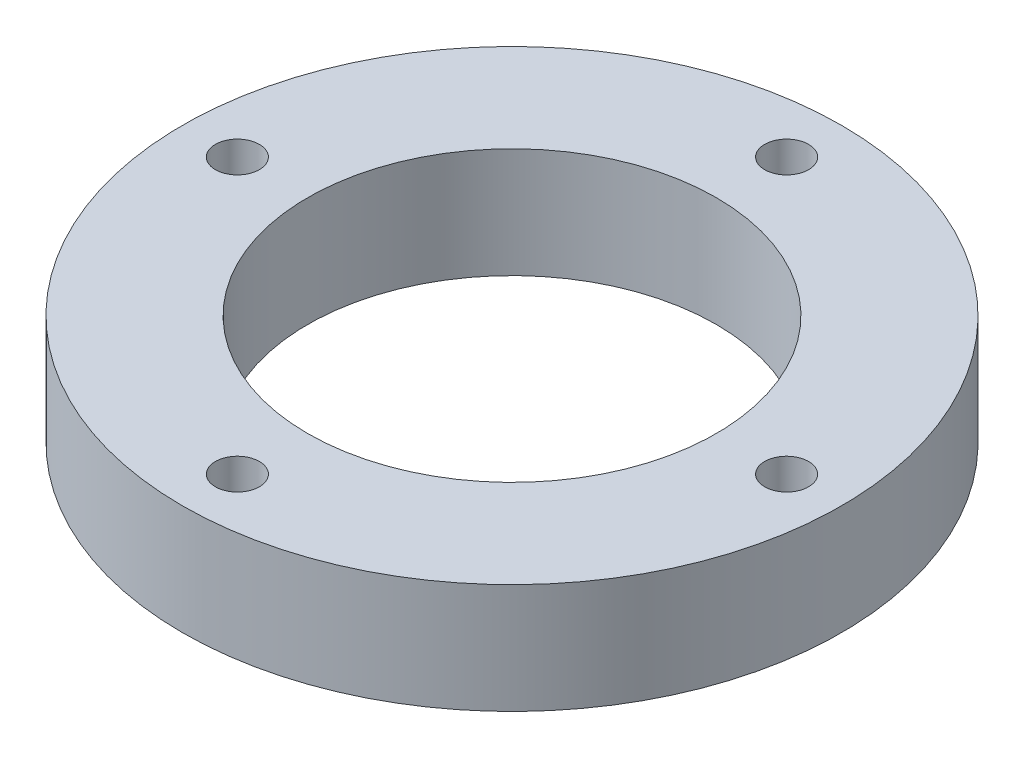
ISO-10303-21;
HEADER;
FILE_DESCRIPTION(('STEP AP214'),'2;1');
FILE_NAME('part.step','',(''),(''),'','','');
FILE_SCHEMA(('AUTOMOTIVE_DESIGN { 1 0 10303 214 1 1 1 1 }'));
ENDSEC;
DATA;
#1=APPLICATION_CONTEXT('core data for automotive mechanical design processes');
#2=APPLICATION_PROTOCOL_DEFINITION('international standard','automotive_design',2000,#1);
#3=PRODUCT_CONTEXT('',#1,'mechanical');
#4=PRODUCT('Part','Part','',(#3));
#5=PRODUCT_RELATED_PRODUCT_CATEGORY('part','',(#4));
#6=PRODUCT_DEFINITION_FORMATION('','',#4);
#7=PRODUCT_DEFINITION_CONTEXT('part definition',#1,'design');
#8=PRODUCT_DEFINITION('design','',#6,#7);
#9=PRODUCT_DEFINITION_SHAPE('','',#8);
#10=(LENGTH_UNIT() NAMED_UNIT(*) SI_UNIT(.MILLI.,.METRE.));
#11=(NAMED_UNIT(*) PLANE_ANGLE_UNIT() SI_UNIT($,.RADIAN.));
#12=(NAMED_UNIT(*) SI_UNIT($,.STERADIAN.) SOLID_ANGLE_UNIT());
#13=UNCERTAINTY_MEASURE_WITH_UNIT(LENGTH_MEASURE(1.E-05),#10,'distance_accuracy_value','');
#14=(GEOMETRIC_REPRESENTATION_CONTEXT(3) GLOBAL_UNCERTAINTY_ASSIGNED_CONTEXT((#13)) GLOBAL_UNIT_ASSIGNED_CONTEXT((#10,
#11,#12)) REPRESENTATION_CONTEXT('',''));
#15=CARTESIAN_POINT('',(0.,0.,0.));
#16=DIRECTION('',(0.,0.,1.));
#17=DIRECTION('',(1.,0.,0.));
#18=AXIS2_PLACEMENT_3D('',#15,#16,#17);
#19=CARTESIAN_POINT('',(0.,0.,0.));
#20=DIRECTION('',(0.,1.,0.));
#21=DIRECTION('',(0.,0.,1.));
#22=AXIS2_PLACEMENT_3D('',#19,#20,#21);
#23=PLANE('',#22);
#24=CARTESIAN_POINT('',(0.,0.,0.));
#25=DIRECTION('',(0.,-1.,0.));
#26=DIRECTION('',(0.,0.,-1.));
#27=AXIS2_PLACEMENT_3D('',#24,#25,#26);
#28=CIRCLE('',#27,30.);
#29=CARTESIAN_POINT('',(0.,0.,-30.));
#30=VERTEX_POINT('',#29);
#31=EDGE_CURVE('E41',#30,#30,#28,.F.);
#32=ORIENTED_EDGE('',*,*,#31,.F.);
#33=EDGE_LOOP('',(#32));
#34=FACE_BOUND('',#33,.T.);
#35=CARTESIAN_POINT('',(0.,0.,0.));
#36=DIRECTION('',(0.,1.,0.));
#37=DIRECTION('',(0.,0.,1.));
#38=AXIS2_PLACEMENT_3D('',#35,#36,#37);
#39=CIRCLE('',#38,18.6);
#40=CARTESIAN_POINT('',(0.,0.,18.6));
#41=VERTEX_POINT('',#40);
#42=EDGE_CURVE('E44',#41,#41,#39,.T.);
#43=ORIENTED_EDGE('',*,*,#42,.T.);
#44=EDGE_LOOP('',(#43));
#45=FACE_BOUND('',#44,.T.);
#46=CARTESIAN_POINT('',(0.,0.,-25.));
#47=DIRECTION('',(0.,1.,0.));
#48=DIRECTION('',(0.,0.,1.));
#49=AXIS2_PLACEMENT_3D('',#46,#47,#48);
#50=CIRCLE('',#49,2.);
#51=CARTESIAN_POINT('',(0.,0.,-23.));
#52=VERTEX_POINT('',#51);
#53=EDGE_CURVE('E47',#52,#52,#50,.T.);
#54=ORIENTED_EDGE('',*,*,#53,.T.);
#55=EDGE_LOOP('',(#54));
#56=FACE_BOUND('',#55,.T.);
#57=CARTESIAN_POINT('',(25.,0.,0.));
#58=DIRECTION('',(0.,1.,0.));
#59=DIRECTION('',(0.,0.,1.));
#60=AXIS2_PLACEMENT_3D('',#57,#58,#59);
#61=CIRCLE('',#60,2.);
#62=CARTESIAN_POINT('',(25.,0.,2.00000000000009));
#63=VERTEX_POINT('',#62);
#64=EDGE_CURVE('E50',#63,#63,#61,.T.);
#65=ORIENTED_EDGE('',*,*,#64,.T.);
#66=EDGE_LOOP('',(#65));
#67=FACE_BOUND('',#66,.T.);
#68=CARTESIAN_POINT('',(0.,0.,25.));
#69=DIRECTION('',(0.,1.,0.));
#70=DIRECTION('',(0.,0.,1.));
#71=AXIS2_PLACEMENT_3D('',#68,#69,#70);
#72=CIRCLE('',#71,2.);
#73=CARTESIAN_POINT('',(0.,0.,27.));
#74=VERTEX_POINT('',#73);
#75=EDGE_CURVE('E52',#74,#74,#72,.T.);
#76=ORIENTED_EDGE('',*,*,#75,.T.);
#77=EDGE_LOOP('',(#76));
#78=FACE_BOUND('',#77,.T.);
#79=CARTESIAN_POINT('',(-25.,0.,-2.61861100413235E-13));
#80=DIRECTION('',(0.,1.,0.));
#81=DIRECTION('',(0.,0.,1.));
#82=AXIS2_PLACEMENT_3D('',#79,#80,#81);
#83=CIRCLE('',#82,2.);
#84=CARTESIAN_POINT('',(-25.,0.,1.99999999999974));
#85=VERTEX_POINT('',#84);
#86=EDGE_CURVE('E18',#85,#85,#83,.T.);
#87=ORIENTED_EDGE('',*,*,#86,.T.);
#88=EDGE_LOOP('',(#87));
#89=FACE_BOUND('',#88,.T.);
#90=ADVANCED_FACE('F15',(#34,#45,#56,#67,#78,#89),#23,.F.);
#91=CARTESIAN_POINT('',(-25.,0.,-2.61861100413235E-13));
#92=DIRECTION('',(0.,1.,0.));
#93=DIRECTION('',(0.,0.,1.));
#94=AXIS2_PLACEMENT_3D('',#91,#92,#93);
#95=CYLINDRICAL_SURFACE('',#94,2.);
#96=CARTESIAN_POINT('',(-25.,10.,-2.61861100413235E-13));
#97=DIRECTION('',(0.,1.,0.));
#98=DIRECTION('',(0.,0.,1.));
#99=AXIS2_PLACEMENT_3D('',#96,#97,#98);
#100=CIRCLE('',#99,2.);
#101=CARTESIAN_POINT('',(-25.,10.,1.99999999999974));
#102=VERTEX_POINT('',#101);
#103=EDGE_CURVE('E38',#102,#102,#100,.F.);
#104=ORIENTED_EDGE('',*,*,#103,.F.);
#105=EDGE_LOOP('',(#104));
#106=FACE_BOUND('',#105,.T.);
#107=ORIENTED_EDGE('',*,*,#86,.F.);
#108=EDGE_LOOP('',(#107));
#109=FACE_BOUND('',#108,.T.);
#110=ADVANCED_FACE('F60',(#106,#109),#95,.F.);
#111=CARTESIAN_POINT('',(0.,0.,25.));
#112=DIRECTION('',(0.,1.,0.));
#113=DIRECTION('',(0.,0.,1.));
#114=AXIS2_PLACEMENT_3D('',#111,#112,#113);
#115=CYLINDRICAL_SURFACE('',#114,2.);
#116=CARTESIAN_POINT('',(0.,10.,25.));
#117=DIRECTION('',(0.,1.,0.));
#118=DIRECTION('',(0.,0.,1.));
#119=AXIS2_PLACEMENT_3D('',#116,#117,#118);
#120=CIRCLE('',#119,2.);
#121=CARTESIAN_POINT('',(0.,10.,27.));
#122=VERTEX_POINT('',#121);
#123=EDGE_CURVE('E35',#122,#122,#120,.F.);
#124=ORIENTED_EDGE('',*,*,#123,.F.);
#125=EDGE_LOOP('',(#124));
#126=FACE_BOUND('',#125,.T.);
#127=ORIENTED_EDGE('',*,*,#75,.F.);
#128=EDGE_LOOP('',(#127));
#129=FACE_BOUND('',#128,.T.);
#130=ADVANCED_FACE('F62',(#126,#129),#115,.F.);
#131=CARTESIAN_POINT('',(25.,0.,0.));
#132=DIRECTION('',(0.,1.,0.));
#133=DIRECTION('',(0.,0.,1.));
#134=AXIS2_PLACEMENT_3D('',#131,#132,#133);
#135=CYLINDRICAL_SURFACE('',#134,2.);
#136=CARTESIAN_POINT('',(25.,10.,0.));
#137=DIRECTION('',(0.,1.,0.));
#138=DIRECTION('',(0.,0.,1.));
#139=AXIS2_PLACEMENT_3D('',#136,#137,#138);
#140=CIRCLE('',#139,2.);
#141=CARTESIAN_POINT('',(25.,10.,2.00000000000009));
#142=VERTEX_POINT('',#141);
#143=EDGE_CURVE('E32',#142,#142,#140,.F.);
#144=ORIENTED_EDGE('',*,*,#143,.F.);
#145=EDGE_LOOP('',(#144));
#146=FACE_BOUND('',#145,.T.);
#147=ORIENTED_EDGE('',*,*,#64,.F.);
#148=EDGE_LOOP('',(#147));
#149=FACE_BOUND('',#148,.T.);
#150=ADVANCED_FACE('F69',(#146,#149),#135,.F.);
#151=CARTESIAN_POINT('',(0.,0.,-25.));
#152=DIRECTION('',(0.,1.,0.));
#153=DIRECTION('',(0.,0.,1.));
#154=AXIS2_PLACEMENT_3D('',#151,#152,#153);
#155=CYLINDRICAL_SURFACE('',#154,2.);
#156=CARTESIAN_POINT('',(0.,10.,-25.));
#157=DIRECTION('',(0.,1.,0.));
#158=DIRECTION('',(0.,0.,1.));
#159=AXIS2_PLACEMENT_3D('',#156,#157,#158);
#160=CIRCLE('',#159,2.);
#161=CARTESIAN_POINT('',(0.,10.,-23.));
#162=VERTEX_POINT('',#161);
#163=EDGE_CURVE('E27',#162,#162,#160,.F.);
#164=ORIENTED_EDGE('',*,*,#163,.F.);
#165=EDGE_LOOP('',(#164));
#166=FACE_BOUND('',#165,.T.);
#167=ORIENTED_EDGE('',*,*,#53,.F.);
#168=EDGE_LOOP('',(#167));
#169=FACE_BOUND('',#168,.T.);
#170=ADVANCED_FACE('F88',(#166,#169),#155,.F.);
#171=CARTESIAN_POINT('',(0.,0.,0.));
#172=DIRECTION('',(0.,1.,0.));
#173=DIRECTION('',(0.,0.,1.));
#174=AXIS2_PLACEMENT_3D('',#171,#172,#173);
#175=CYLINDRICAL_SURFACE('',#174,18.6);
#176=CARTESIAN_POINT('',(0.,10.,0.));
#177=DIRECTION('',(0.,1.,0.));
#178=DIRECTION('',(0.,0.,1.));
#179=AXIS2_PLACEMENT_3D('',#176,#177,#178);
#180=CIRCLE('',#179,18.6);
#181=CARTESIAN_POINT('',(0.,10.,18.6));
#182=VERTEX_POINT('',#181);
#183=EDGE_CURVE('E22',#182,#182,#180,.F.);
#184=ORIENTED_EDGE('',*,*,#183,.F.);
#185=EDGE_LOOP('',(#184));
#186=FACE_BOUND('',#185,.T.);
#187=ORIENTED_EDGE('',*,*,#42,.F.);
#188=EDGE_LOOP('',(#187));
#189=FACE_BOUND('',#188,.T.);
#190=ADVANCED_FACE('F81',(#186,#189),#175,.F.);
#191=CARTESIAN_POINT('',(0.,10.,0.));
#192=DIRECTION('',(0.,-1.,0.));
#193=DIRECTION('',(0.,0.,-1.));
#194=AXIS2_PLACEMENT_3D('',#191,#192,#193);
#195=CYLINDRICAL_SURFACE('',#194,30.);
#196=ORIENTED_EDGE('',*,*,#31,.T.);
#197=EDGE_LOOP('',(#196));
#198=FACE_BOUND('',#197,.T.);
#199=CARTESIAN_POINT('',(0.,10.,0.));
#200=DIRECTION('',(0.,-1.,0.));
#201=DIRECTION('',(0.,0.,-1.));
#202=AXIS2_PLACEMENT_3D('',#199,#200,#201);
#203=CIRCLE('',#202,30.);
#204=CARTESIAN_POINT('',(0.,10.,-30.));
#205=VERTEX_POINT('',#204);
#206=EDGE_CURVE('E10',#205,#205,#203,.F.);
#207=ORIENTED_EDGE('',*,*,#206,.F.);
#208=EDGE_LOOP('',(#207));
#209=FACE_BOUND('',#208,.T.);
#210=ADVANCED_FACE('F76',(#198,#209),#195,.T.);
#211=CARTESIAN_POINT('',(0.,10.,0.));
#212=DIRECTION('',(0.,1.,0.));
#213=DIRECTION('',(0.,0.,1.));
#214=AXIS2_PLACEMENT_3D('',#211,#212,#213);
#215=PLANE('',#214);
#216=ORIENTED_EDGE('',*,*,#206,.T.);
#217=EDGE_LOOP('',(#216));
#218=FACE_BOUND('',#217,.T.);
#219=ORIENTED_EDGE('',*,*,#183,.T.);
#220=EDGE_LOOP('',(#219));
#221=FACE_BOUND('',#220,.T.);
#222=ORIENTED_EDGE('',*,*,#163,.T.);
#223=EDGE_LOOP('',(#222));
#224=FACE_BOUND('',#223,.T.);
#225=ORIENTED_EDGE('',*,*,#143,.T.);
#226=EDGE_LOOP('',(#225));
#227=FACE_BOUND('',#226,.T.);
#228=ORIENTED_EDGE('',*,*,#123,.T.);
#229=EDGE_LOOP('',(#228));
#230=FACE_BOUND('',#229,.T.);
#231=ORIENTED_EDGE('',*,*,#103,.T.);
#232=EDGE_LOOP('',(#231));
#233=FACE_BOUND('',#232,.T.);
#234=ADVANCED_FACE('F74',(#218,#221,#224,#227,#230,#233),#215,.T.);
#235=CLOSED_SHELL('',(#90,#110,#130,#150,#170,#190,#210,#234));
#236=MANIFOLD_SOLID_BREP('B1',#235);
#237=ADVANCED_BREP_SHAPE_REPRESENTATION('',(#18,#236),#14);
#238=SHAPE_DEFINITION_REPRESENTATION(#9,#237);
ENDSEC;
END-ISO-10303-21;
